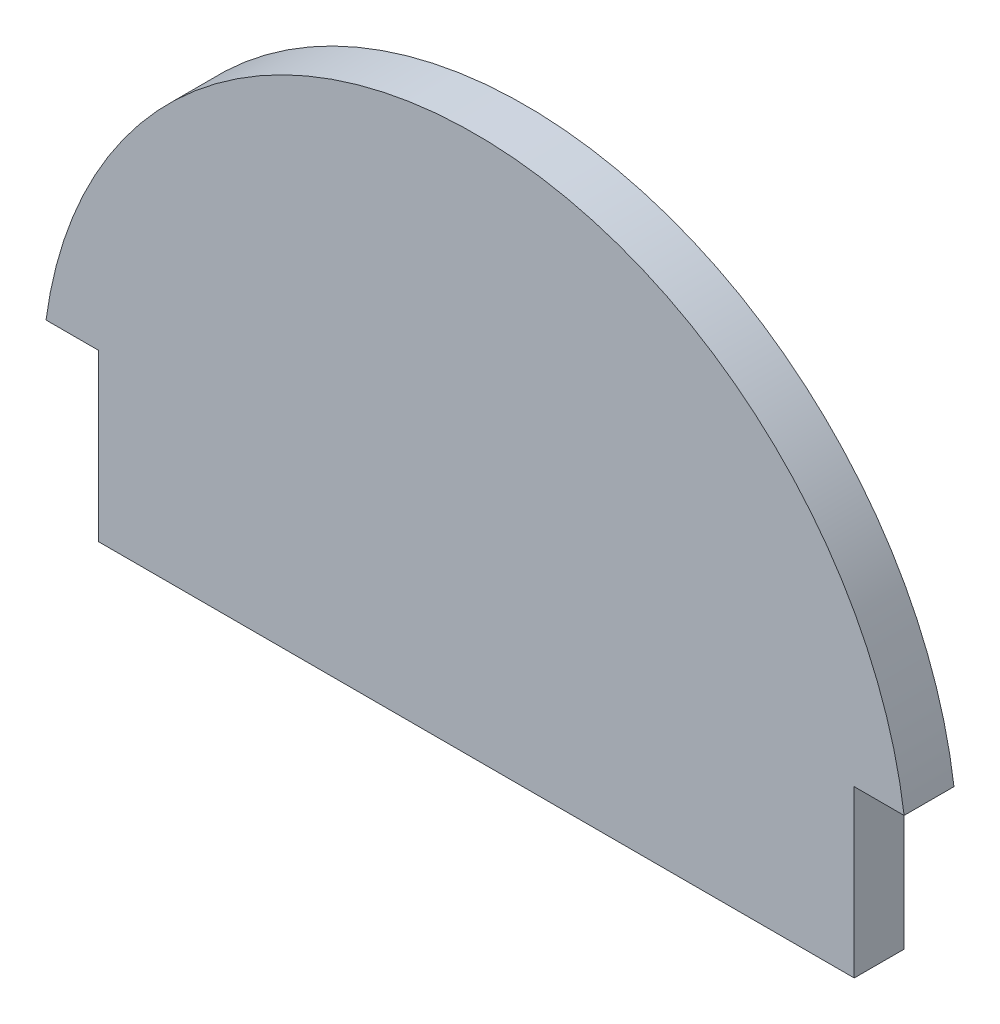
ISO-10303-21;
HEADER;
FILE_DESCRIPTION(('STEP AP214'),'2;1');
FILE_NAME('part.step','',(''),(''),'','','');
FILE_SCHEMA(('AUTOMOTIVE_DESIGN { 1 0 10303 214 1 1 1 1 }'));
ENDSEC;
DATA;
#1=APPLICATION_CONTEXT('core data for automotive mechanical design processes');
#2=APPLICATION_PROTOCOL_DEFINITION('international standard','automotive_design',2000,#1);
#3=PRODUCT_CONTEXT('',#1,'mechanical');
#4=PRODUCT('Part','Part','',(#3));
#5=PRODUCT_RELATED_PRODUCT_CATEGORY('part','',(#4));
#6=PRODUCT_DEFINITION_FORMATION('','',#4);
#7=PRODUCT_DEFINITION_CONTEXT('part definition',#1,'design');
#8=PRODUCT_DEFINITION('design','',#6,#7);
#9=PRODUCT_DEFINITION_SHAPE('','',#8);
#10=(LENGTH_UNIT() NAMED_UNIT(*) SI_UNIT(.MILLI.,.METRE.));
#11=(NAMED_UNIT(*) PLANE_ANGLE_UNIT() SI_UNIT($,.RADIAN.));
#12=(NAMED_UNIT(*) SI_UNIT($,.STERADIAN.) SOLID_ANGLE_UNIT());
#13=UNCERTAINTY_MEASURE_WITH_UNIT(LENGTH_MEASURE(1.E-05),#10,'distance_accuracy_value','');
#14=(GEOMETRIC_REPRESENTATION_CONTEXT(3) GLOBAL_UNCERTAINTY_ASSIGNED_CONTEXT((#13)) GLOBAL_UNIT_ASSIGNED_CONTEXT((#10,
#11,#12)) REPRESENTATION_CONTEXT('',''));
#15=CARTESIAN_POINT('',(0.,0.,0.));
#16=DIRECTION('',(0.,0.,1.));
#17=DIRECTION('',(1.,0.,0.));
#18=AXIS2_PLACEMENT_3D('',#15,#16,#17);
#19=CARTESIAN_POINT('',(13.1087965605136,8.39375197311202,-1.524));
#20=DIRECTION('',(0.,0.,1.));
#21=DIRECTION('',(1.,0.,0.));
#22=AXIS2_PLACEMENT_3D('',#19,#20,#21);
#23=CYLINDRICAL_SURFACE('',#22,13.2239555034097);
#24=CARTESIAN_POINT('',(13.1087965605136,8.39375197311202,0.));
#25=DIRECTION('',(0.,0.,1.));
#26=DIRECTION('',(-1.,0.,0.));
#27=AXIS2_PLACEMENT_3D('',#24,#25,#26);
#28=CIRCLE('',#27,13.2239555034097);
#29=CARTESIAN_POINT('',(26.2175931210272,10.1351456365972,0.));
#30=VERTEX_POINT('',#29);
#31=CARTESIAN_POINT('',(0.,10.1351456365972,0.));
#32=VERTEX_POINT('',#31);
#33=EDGE_CURVE('E119',#30,#32,#28,.T.);
#34=ORIENTED_EDGE('',*,*,#33,.F.);
#35=DIRECTION('',(0.,0.,1.));
#36=VECTOR('',#35,1.);
#37=CARTESIAN_POINT('',(26.2175931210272,10.1351456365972,-1.524));
#38=LINE('',#37,#36);
#39=CARTESIAN_POINT('',(26.2175931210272,10.1351456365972,-1.524));
#40=VERTEX_POINT('',#39);
#41=EDGE_CURVE('E11',#40,#30,#38,.T.);
#42=ORIENTED_EDGE('',*,*,#41,.F.);
#43=CARTESIAN_POINT('',(13.1087965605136,8.39375197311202,-1.524));
#44=DIRECTION('',(0.,0.,1.));
#45=DIRECTION('',(-1.,0.,0.));
#46=AXIS2_PLACEMENT_3D('',#43,#44,#45);
#47=CIRCLE('',#46,13.2239555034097);
#48=CARTESIAN_POINT('',(0.,10.1351456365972,-1.524));
#49=VERTEX_POINT('',#48);
#50=EDGE_CURVE('E133',#40,#49,#47,.T.);
#51=ORIENTED_EDGE('',*,*,#50,.T.);
#52=DIRECTION('',(0.,0.,1.));
#53=VECTOR('',#52,1.);
#54=CARTESIAN_POINT('',(0.,10.1351456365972,-1.524));
#55=LINE('',#54,#53);
#56=EDGE_CURVE('E37',#49,#32,#55,.T.);
#57=ORIENTED_EDGE('',*,*,#56,.T.);
#58=EDGE_LOOP('',(#34,#42,#51,#57));
#59=FACE_BOUND('',#58,.T.);
#60=ADVANCED_FACE('F34',(#59),#23,.T.);
#61=CARTESIAN_POINT('',(24.6935931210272,10.1351456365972,-1.524));
#62=DIRECTION('',(0.,-1.,0.));
#63=DIRECTION('',(0.,0.,-1.));
#64=AXIS2_PLACEMENT_3D('',#61,#62,#63);
#65=PLANE('',#64);
#66=DIRECTION('',(1.,0.,0.));
#67=VECTOR('',#66,1.);
#68=CARTESIAN_POINT('',(24.6935931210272,10.1351456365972,0.));
#69=LINE('',#68,#67);
#70=CARTESIAN_POINT('',(24.6935931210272,10.1351456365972,0.));
#71=VERTEX_POINT('',#70);
#72=EDGE_CURVE('E131',#71,#30,#69,.T.);
#73=ORIENTED_EDGE('',*,*,#72,.F.);
#74=DIRECTION('',(0.,0.,1.));
#75=VECTOR('',#74,1.);
#76=CARTESIAN_POINT('',(24.6935931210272,10.1351456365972,-1.524));
#77=LINE('',#76,#75);
#78=CARTESIAN_POINT('',(24.6935931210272,10.1351456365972,-1.524));
#79=VERTEX_POINT('',#78);
#80=EDGE_CURVE('E43',#79,#71,#77,.T.);
#81=ORIENTED_EDGE('',*,*,#80,.F.);
#82=DIRECTION('',(1.,0.,0.));
#83=VECTOR('',#82,1.);
#84=CARTESIAN_POINT('',(24.6935931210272,10.1351456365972,-1.524));
#85=LINE('',#84,#83);
#86=EDGE_CURVE('E109',#79,#40,#85,.T.);
#87=ORIENTED_EDGE('',*,*,#86,.T.);
#88=ORIENTED_EDGE('',*,*,#41,.T.);
#89=EDGE_LOOP('',(#73,#81,#87,#88));
#90=FACE_BOUND('',#89,.T.);
#91=ADVANCED_FACE('F141',(#90),#65,.T.);
#92=CARTESIAN_POINT('',(24.6935931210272,10.1351456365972,-1.524));
#93=DIRECTION('',(1.,0.,0.));
#94=DIRECTION('',(0.,0.,-1.));
#95=AXIS2_PLACEMENT_3D('',#92,#93,#94);
#96=PLANE('',#95);
#97=DIRECTION('',(0.,1.,0.));
#98=VECTOR('',#97,1.);
#99=CARTESIAN_POINT('',(24.6935931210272,10.1351456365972,0.));
#100=LINE('',#99,#98);
#101=CARTESIAN_POINT('',(24.6935931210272,5.07205569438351,0.));
#102=VERTEX_POINT('',#101);
#103=EDGE_CURVE('E96',#102,#71,#100,.T.);
#104=ORIENTED_EDGE('',*,*,#103,.F.);
#105=DIRECTION('',(0.,0.,1.));
#106=VECTOR('',#105,1.);
#107=CARTESIAN_POINT('',(24.6935931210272,5.07205569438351,-1.524));
#108=LINE('',#107,#106);
#109=CARTESIAN_POINT('',(24.6935931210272,5.07205569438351,-1.524));
#110=VERTEX_POINT('',#109);
#111=EDGE_CURVE('E91',#110,#102,#108,.T.);
#112=ORIENTED_EDGE('',*,*,#111,.F.);
#113=DIRECTION('',(0.,1.,0.));
#114=VECTOR('',#113,1.);
#115=CARTESIAN_POINT('',(24.6935931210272,10.1351456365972,-1.524));
#116=LINE('',#115,#114);
#117=EDGE_CURVE('E94',#110,#79,#116,.T.);
#118=ORIENTED_EDGE('',*,*,#117,.T.);
#119=ORIENTED_EDGE('',*,*,#80,.T.);
#120=EDGE_LOOP('',(#104,#112,#118,#119));
#121=FACE_BOUND('',#120,.T.);
#122=ADVANCED_FACE('F93',(#121),#96,.T.);
#123=CARTESIAN_POINT('',(1.60593753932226,5.07205569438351,-1.524));
#124=DIRECTION('',(0.,-1.,0.));
#125=DIRECTION('',(0.,0.,-1.));
#126=AXIS2_PLACEMENT_3D('',#123,#124,#125);
#127=PLANE('',#126);
#128=DIRECTION('',(1.,0.,0.));
#129=VECTOR('',#128,1.);
#130=CARTESIAN_POINT('',(1.60593753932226,5.07205569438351,0.));
#131=LINE('',#130,#129);
#132=CARTESIAN_POINT('',(1.60593753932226,5.07205569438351,0.));
#133=VERTEX_POINT('',#132);
#134=EDGE_CURVE('E128',#133,#102,#131,.T.);
#135=ORIENTED_EDGE('',*,*,#134,.F.);
#136=DIRECTION('',(0.,0.,1.));
#137=VECTOR('',#136,1.);
#138=CARTESIAN_POINT('',(1.60593753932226,5.07205569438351,-1.524));
#139=LINE('',#138,#137);
#140=CARTESIAN_POINT('',(1.60593753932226,5.07205569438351,-1.524));
#141=VERTEX_POINT('',#140);
#142=EDGE_CURVE('E101',#141,#133,#139,.T.);
#143=ORIENTED_EDGE('',*,*,#142,.F.);
#144=DIRECTION('',(1.,0.,0.));
#145=VECTOR('',#144,1.);
#146=CARTESIAN_POINT('',(1.60593753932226,5.07205569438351,-1.524));
#147=LINE('',#146,#145);
#148=EDGE_CURVE('E107',#141,#110,#147,.T.);
#149=ORIENTED_EDGE('',*,*,#148,.T.);
#150=ORIENTED_EDGE('',*,*,#111,.T.);
#151=EDGE_LOOP('',(#135,#143,#149,#150));
#152=FACE_BOUND('',#151,.T.);
#153=ADVANCED_FACE('F111',(#152),#127,.T.);
#154=CARTESIAN_POINT('',(1.60593753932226,10.1351456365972,-1.524));
#155=DIRECTION('',(-1.,0.,0.));
#156=DIRECTION('',(0.,0.,1.));
#157=AXIS2_PLACEMENT_3D('',#154,#155,#156);
#158=PLANE('',#157);
#159=DIRECTION('',(0.,-1.,0.));
#160=VECTOR('',#159,1.);
#161=CARTESIAN_POINT('',(1.60593753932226,10.1351456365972,0.));
#162=LINE('',#161,#160);
#163=CARTESIAN_POINT('',(1.60593753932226,10.1351456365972,0.));
#164=VERTEX_POINT('',#163);
#165=EDGE_CURVE('E125',#164,#133,#162,.T.);
#166=ORIENTED_EDGE('',*,*,#165,.F.);
#167=DIRECTION('',(0.,0.,1.));
#168=VECTOR('',#167,1.);
#169=CARTESIAN_POINT('',(1.60593753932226,10.1351456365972,-1.524));
#170=LINE('',#169,#168);
#171=CARTESIAN_POINT('',(1.60593753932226,10.1351456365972,-1.524));
#172=VERTEX_POINT('',#171);
#173=EDGE_CURVE('E136',#172,#164,#170,.T.);
#174=ORIENTED_EDGE('',*,*,#173,.F.);
#175=DIRECTION('',(0.,-1.,0.));
#176=VECTOR('',#175,1.);
#177=CARTESIAN_POINT('',(1.60593753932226,10.1351456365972,-1.524));
#178=LINE('',#177,#176);
#179=EDGE_CURVE('E112',#172,#141,#178,.T.);
#180=ORIENTED_EDGE('',*,*,#179,.T.);
#181=ORIENTED_EDGE('',*,*,#142,.T.);
#182=EDGE_LOOP('',(#166,#174,#180,#181));
#183=FACE_BOUND('',#182,.T.);
#184=ADVANCED_FACE('F154',(#183),#158,.T.);
#185=CARTESIAN_POINT('',(0.,10.1351456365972,-1.524));
#186=DIRECTION('',(0.,-1.,0.));
#187=DIRECTION('',(0.,0.,-1.));
#188=AXIS2_PLACEMENT_3D('',#185,#186,#187);
#189=PLANE('',#188);
#190=DIRECTION('',(1.,0.,0.));
#191=VECTOR('',#190,1.);
#192=CARTESIAN_POINT('',(0.,10.1351456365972,0.));
#193=LINE('',#192,#191);
#194=EDGE_CURVE('E122',#32,#164,#193,.T.);
#195=ORIENTED_EDGE('',*,*,#194,.F.);
#196=ORIENTED_EDGE('',*,*,#56,.F.);
#197=DIRECTION('',(1.,0.,0.));
#198=VECTOR('',#197,1.);
#199=CARTESIAN_POINT('',(0.,10.1351456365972,-1.524));
#200=LINE('',#199,#198);
#201=EDGE_CURVE('E114',#49,#172,#200,.T.);
#202=ORIENTED_EDGE('',*,*,#201,.T.);
#203=ORIENTED_EDGE('',*,*,#173,.T.);
#204=EDGE_LOOP('',(#195,#196,#202,#203));
#205=FACE_BOUND('',#204,.T.);
#206=ADVANCED_FACE('F138',(#205),#189,.T.);
#207=CARTESIAN_POINT('',(13.1087965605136,8.39375197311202,-1.524));
#208=DIRECTION('',(0.,0.,-1.));
#209=DIRECTION('',(-1.,0.,0.));
#210=AXIS2_PLACEMENT_3D('',#207,#208,#209);
#211=PLANE('',#210);
#212=ORIENTED_EDGE('',*,*,#50,.F.);
#213=ORIENTED_EDGE('',*,*,#86,.F.);
#214=ORIENTED_EDGE('',*,*,#117,.F.);
#215=ORIENTED_EDGE('',*,*,#148,.F.);
#216=ORIENTED_EDGE('',*,*,#179,.F.);
#217=ORIENTED_EDGE('',*,*,#201,.F.);
#218=EDGE_LOOP('',(#212,#213,#214,#215,#216,#217));
#219=FACE_BOUND('',#218,.T.);
#220=ADVANCED_FACE('F105',(#219),#211,.T.);
#221=CARTESIAN_POINT('',(13.1087965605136,8.39375197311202,0.));
#222=DIRECTION('',(0.,0.,-1.));
#223=DIRECTION('',(-1.,0.,0.));
#224=AXIS2_PLACEMENT_3D('',#221,#222,#223);
#225=PLANE('',#224);
#226=ORIENTED_EDGE('',*,*,#33,.T.);
#227=ORIENTED_EDGE('',*,*,#194,.T.);
#228=ORIENTED_EDGE('',*,*,#165,.T.);
#229=ORIENTED_EDGE('',*,*,#134,.T.);
#230=ORIENTED_EDGE('',*,*,#103,.T.);
#231=ORIENTED_EDGE('',*,*,#72,.T.);
#232=EDGE_LOOP('',(#226,#227,#228,#229,#230,#231));
#233=FACE_BOUND('',#232,.T.);
#234=ADVANCED_FACE('F140',(#233),#225,.F.);
#235=CLOSED_SHELL('',(#60,#91,#122,#153,#184,#206,#220,#234));
#236=MANIFOLD_SOLID_BREP('B2',#235);
#237=ADVANCED_BREP_SHAPE_REPRESENTATION('',(#18,#236),#14);
#238=SHAPE_DEFINITION_REPRESENTATION(#9,#237);
ENDSEC;
END-ISO-10303-21;
